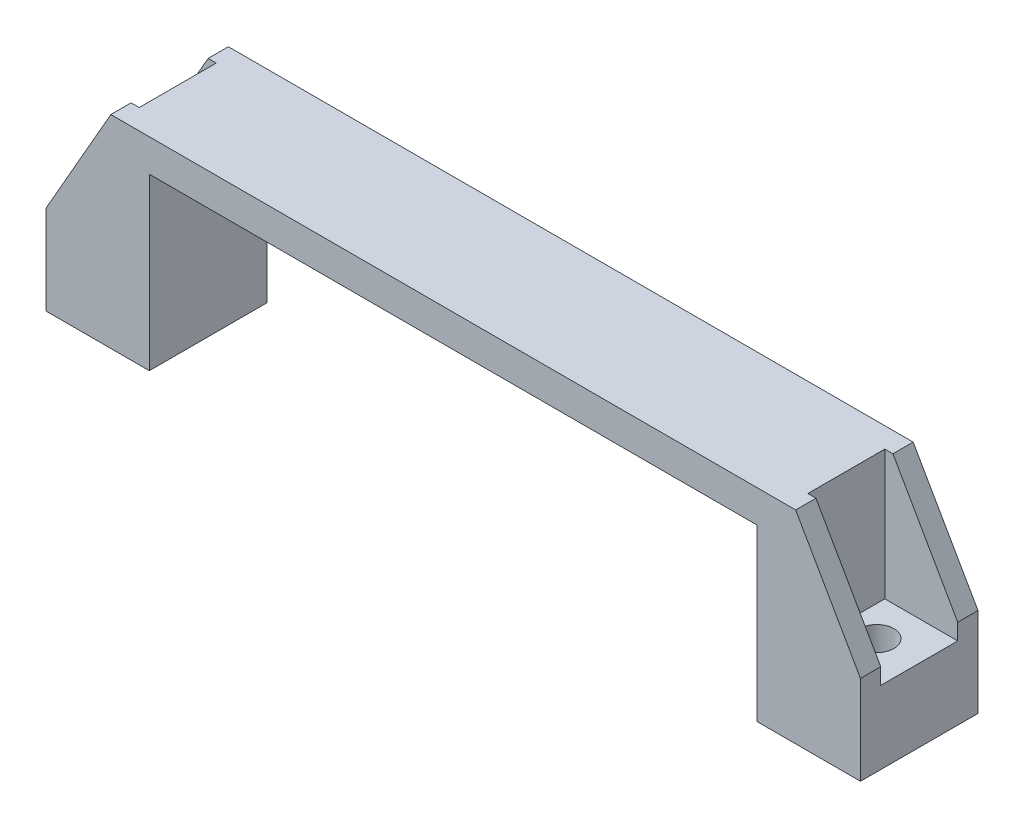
ISO-10303-21;
HEADER;
FILE_DESCRIPTION(('STEP AP214'),'2;1');
FILE_NAME('part.step','',(''),(''),'','','');
FILE_SCHEMA(('AUTOMOTIVE_DESIGN { 1 0 10303 214 1 1 1 1 }'));
ENDSEC;
DATA;
#1=APPLICATION_CONTEXT('core data for automotive mechanical design processes');
#2=APPLICATION_PROTOCOL_DEFINITION('international standard','automotive_design',2000,#1);
#3=PRODUCT_CONTEXT('',#1,'mechanical');
#4=PRODUCT('Part','Part','',(#3));
#5=PRODUCT_RELATED_PRODUCT_CATEGORY('part','',(#4));
#6=PRODUCT_DEFINITION_FORMATION('','',#4);
#7=PRODUCT_DEFINITION_CONTEXT('part definition',#1,'design');
#8=PRODUCT_DEFINITION('design','',#6,#7);
#9=PRODUCT_DEFINITION_SHAPE('','',#8);
#10=(LENGTH_UNIT() NAMED_UNIT(*) SI_UNIT(.MILLI.,.METRE.));
#11=(NAMED_UNIT(*) PLANE_ANGLE_UNIT() SI_UNIT($,.RADIAN.));
#12=(NAMED_UNIT(*) SI_UNIT($,.STERADIAN.) SOLID_ANGLE_UNIT());
#13=UNCERTAINTY_MEASURE_WITH_UNIT(LENGTH_MEASURE(1.E-05),#10,'distance_accuracy_value','');
#14=(GEOMETRIC_REPRESENTATION_CONTEXT(3) GLOBAL_UNCERTAINTY_ASSIGNED_CONTEXT((#13)) GLOBAL_UNIT_ASSIGNED_CONTEXT((#10,
#11,#12)) REPRESENTATION_CONTEXT('',''));
#15=CARTESIAN_POINT('',(0.,0.,0.));
#16=DIRECTION('',(0.,0.,1.));
#17=DIRECTION('',(1.,0.,0.));
#18=AXIS2_PLACEMENT_3D('',#15,#16,#17);
#19=CARTESIAN_POINT('',(100.5,-3.,-14.5));
#20=DIRECTION('',(-0.868243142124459,-0.496138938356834,0.));
#21=DIRECTION('',(0.496138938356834,-0.868243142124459,0.));
#22=AXIS2_PLACEMENT_3D('',#19,#20,#21);
#23=PLANE('',#22);
#24=DIRECTION('',(0.,0.,1.));
#25=VECTOR('',#24,1.);
#26=CARTESIAN_POINT('',(84.5,25.,-14.5));
#27=LINE('',#26,#25);
#28=CARTESIAN_POINT('',(84.5,25.,-14.5));
#29=VERTEX_POINT('',#28);
#30=CARTESIAN_POINT('',(84.5,25.,-9.50000000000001));
#31=VERTEX_POINT('',#30);
#32=EDGE_CURVE('E257',#29,#31,#27,.T.);
#33=ORIENTED_EDGE('',*,*,#32,.T.);
#34=DIRECTION('',(0.496138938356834,-0.868243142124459,0.));
#35=VECTOR('',#34,1.);
#36=CARTESIAN_POINT('',(100.5,-3.,-9.50000000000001));
#37=LINE('',#36,#35);
#38=CARTESIAN_POINT('',(100.5,-3.,-9.50000000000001));
#39=VERTEX_POINT('',#38);
#40=EDGE_CURVE('E11',#31,#39,#37,.T.);
#41=ORIENTED_EDGE('',*,*,#40,.T.);
#42=DIRECTION('',(0.,0.,1.));
#43=VECTOR('',#42,1.);
#44=CARTESIAN_POINT('',(100.5,-3.,-14.5));
#45=LINE('',#44,#43);
#46=CARTESIAN_POINT('',(100.5,-3.,-14.5));
#47=VERTEX_POINT('',#46);
#48=EDGE_CURVE('E252',#47,#39,#45,.T.);
#49=ORIENTED_EDGE('',*,*,#48,.F.);
#50=DIRECTION('',(0.496138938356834,-0.868243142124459,0.));
#51=VECTOR('',#50,1.);
#52=CARTESIAN_POINT('',(100.5,-3.,-14.5));
#53=LINE('',#52,#51);
#54=EDGE_CURVE('E246',#29,#47,#53,.T.);
#55=ORIENTED_EDGE('',*,*,#54,.F.);
#56=EDGE_LOOP('',(#33,#41,#49,#55));
#57=FACE_BOUND('',#56,.T.);
#58=ADVANCED_FACE('F33',(#57),#23,.F.);
#59=CARTESIAN_POINT('',(90.,25.,0.));
#60=DIRECTION('',(0.,-1.,0.));
#61=DIRECTION('',(0.,0.,-1.));
#62=AXIS2_PLACEMENT_3D('',#59,#60,#61);
#63=CYLINDRICAL_SURFACE('',#62,4.25000000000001);
#64=CARTESIAN_POINT('',(90.,-25.,0.));
#65=DIRECTION('',(0.,-1.,0.));
#66=DIRECTION('',(0.,0.,-1.));
#67=AXIS2_PLACEMENT_3D('',#64,#65,#66);
#68=CIRCLE('',#67,4.25000000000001);
#69=CARTESIAN_POINT('',(90.,-25.,-4.25000000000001));
#70=VERTEX_POINT('',#69);
#71=EDGE_CURVE('E239',#70,#70,#68,.T.);
#72=ORIENTED_EDGE('',*,*,#71,.T.);
#73=EDGE_LOOP('',(#72));
#74=FACE_BOUND('',#73,.T.);
#75=CARTESIAN_POINT('',(90.,-7.,0.));
#76=DIRECTION('',(0.,1.,0.));
#77=DIRECTION('',(0.,0.,1.));
#78=AXIS2_PLACEMENT_3D('',#75,#76,#77);
#79=CIRCLE('',#78,4.25000000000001);
#80=CARTESIAN_POINT('',(90.,-7.,4.25000000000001));
#81=VERTEX_POINT('',#80);
#82=EDGE_CURVE('E205',#81,#81,#79,.F.);
#83=ORIENTED_EDGE('',*,*,#82,.F.);
#84=EDGE_LOOP('',(#83));
#85=FACE_BOUND('',#84,.T.);
#86=ADVANCED_FACE('F415',(#74,#85),#63,.F.);
#87=CARTESIAN_POINT('',(-100.5,-3.,-14.5));
#88=DIRECTION('',(0.868243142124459,-0.496138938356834,0.));
#89=DIRECTION('',(0.496138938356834,0.868243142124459,0.));
#90=AXIS2_PLACEMENT_3D('',#87,#88,#89);
#91=PLANE('',#90);
#92=DIRECTION('',(0.,0.,1.));
#93=VECTOR('',#92,1.);
#94=CARTESIAN_POINT('',(-100.5,-3.,-14.5));
#95=LINE('',#94,#93);
#96=CARTESIAN_POINT('',(-100.5,-3.,-14.5));
#97=VERTEX_POINT('',#96);
#98=CARTESIAN_POINT('',(-100.5,-3.,-9.5));
#99=VERTEX_POINT('',#98);
#100=EDGE_CURVE('E266',#97,#99,#95,.T.);
#101=ORIENTED_EDGE('',*,*,#100,.T.);
#102=DIRECTION('',(0.496138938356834,0.868243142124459,0.));
#103=VECTOR('',#102,1.);
#104=CARTESIAN_POINT('',(-100.5,-3.,-9.5));
#105=LINE('',#104,#103);
#106=CARTESIAN_POINT('',(-84.5,25.,-9.5));
#107=VERTEX_POINT('',#106);
#108=EDGE_CURVE('E332',#99,#107,#105,.T.);
#109=ORIENTED_EDGE('',*,*,#108,.T.);
#110=DIRECTION('',(0.,0.,1.));
#111=VECTOR('',#110,1.);
#112=CARTESIAN_POINT('',(-84.5,25.,-14.5));
#113=LINE('',#112,#111);
#114=CARTESIAN_POINT('',(-84.5,25.,-14.5));
#115=VERTEX_POINT('',#114);
#116=EDGE_CURVE('E271',#115,#107,#113,.T.);
#117=ORIENTED_EDGE('',*,*,#116,.F.);
#118=DIRECTION('',(0.496138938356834,0.868243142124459,0.));
#119=VECTOR('',#118,1.);
#120=CARTESIAN_POINT('',(-100.5,-3.,-14.5));
#121=LINE('',#120,#119);
#122=EDGE_CURVE('E260',#97,#115,#121,.T.);
#123=ORIENTED_EDGE('',*,*,#122,.F.);
#124=EDGE_LOOP('',(#101,#109,#117,#123));
#125=FACE_BOUND('',#124,.T.);
#126=ADVANCED_FACE('F391',(#125),#91,.F.);
#127=CARTESIAN_POINT('',(-90.,25.,0.));
#128=DIRECTION('',(0.,-1.,0.));
#129=DIRECTION('',(0.,0.,-1.));
#130=AXIS2_PLACEMENT_3D('',#127,#128,#129);
#131=CYLINDRICAL_SURFACE('',#130,4.25000000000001);
#132=CARTESIAN_POINT('',(-90.,-25.,0.));
#133=DIRECTION('',(0.,-1.,0.));
#134=DIRECTION('',(0.,0.,-1.));
#135=AXIS2_PLACEMENT_3D('',#132,#133,#134);
#136=CIRCLE('',#135,4.25000000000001);
#137=CARTESIAN_POINT('',(-90.,-25.,-4.25000000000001));
#138=VERTEX_POINT('',#137);
#139=EDGE_CURVE('E242',#138,#138,#136,.T.);
#140=ORIENTED_EDGE('',*,*,#139,.T.);
#141=EDGE_LOOP('',(#140));
#142=FACE_BOUND('',#141,.T.);
#143=CARTESIAN_POINT('',(-90.,-7.,0.));
#144=DIRECTION('',(0.,1.,0.));
#145=DIRECTION('',(0.,0.,1.));
#146=AXIS2_PLACEMENT_3D('',#143,#144,#145);
#147=CIRCLE('',#146,4.25000000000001);
#148=CARTESIAN_POINT('',(-90.,-7.,4.25000000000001));
#149=VERTEX_POINT('',#148);
#150=EDGE_CURVE('E232',#149,#149,#147,.F.);
#151=ORIENTED_EDGE('',*,*,#150,.F.);
#152=EDGE_LOOP('',(#151));
#153=FACE_BOUND('',#152,.T.);
#154=ADVANCED_FACE('F433',(#142,#153),#131,.F.);
#155=CARTESIAN_POINT('',(-100.5,-25.,14.5));
#156=DIRECTION('',(0.,1.,0.));
#157=DIRECTION('',(0.,0.,1.));
#158=AXIS2_PLACEMENT_3D('',#155,#156,#157);
#159=PLANE('',#158);
#160=ORIENTED_EDGE('',*,*,#139,.F.);
#161=EDGE_LOOP('',(#160));
#162=FACE_BOUND('',#161,.T.);
#163=DIRECTION('',(1.,0.,0.));
#164=VECTOR('',#163,1.);
#165=CARTESIAN_POINT('',(-100.5,-25.,-14.5));
#166=LINE('',#165,#164);
#167=CARTESIAN_POINT('',(-100.5,-25.,-14.5));
#168=VERTEX_POINT('',#167);
#169=CARTESIAN_POINT('',(-75.,-25.,-14.5));
#170=VERTEX_POINT('',#169);
#171=EDGE_CURVE('E316',#168,#170,#166,.T.);
#172=ORIENTED_EDGE('',*,*,#171,.T.);
#173=DIRECTION('',(0.,0.,1.));
#174=VECTOR('',#173,1.);
#175=CARTESIAN_POINT('',(-75.,-25.,-14.5));
#176=LINE('',#175,#174);
#177=CARTESIAN_POINT('',(-75.,-25.,14.5));
#178=VERTEX_POINT('',#177);
#179=EDGE_CURVE('E284',#170,#178,#176,.T.);
#180=ORIENTED_EDGE('',*,*,#179,.T.);
#181=DIRECTION('',(1.,0.,0.));
#182=VECTOR('',#181,1.);
#183=CARTESIAN_POINT('',(-100.5,-25.,14.5));
#184=LINE('',#183,#182);
#185=CARTESIAN_POINT('',(-100.5,-25.,14.5));
#186=VERTEX_POINT('',#185);
#187=EDGE_CURVE('E304',#186,#178,#184,.T.);
#188=ORIENTED_EDGE('',*,*,#187,.F.);
#189=DIRECTION('',(0.,0.,-1.));
#190=VECTOR('',#189,1.);
#191=CARTESIAN_POINT('',(-100.5,-25.,14.5));
#192=LINE('',#191,#190);
#193=EDGE_CURVE('E325',#186,#168,#192,.T.);
#194=ORIENTED_EDGE('',*,*,#193,.T.);
#195=EDGE_LOOP('',(#172,#180,#188,#194));
#196=FACE_BOUND('',#195,.T.);
#197=ADVANCED_FACE('F359',(#162,#196),#159,.F.);
#198=CARTESIAN_POINT('',(-100.5,25.,14.5));
#199=DIRECTION('',(1.,0.,0.));
#200=DIRECTION('',(0.,1.,0.));
#201=AXIS2_PLACEMENT_3D('',#198,#199,#200);
#202=PLANE('',#201);
#203=DIRECTION('',(0.,0.,1.));
#204=VECTOR('',#203,1.);
#205=CARTESIAN_POINT('',(-100.5,-7.,-9.5));
#206=LINE('',#205,#204);
#207=CARTESIAN_POINT('',(-100.5,-7.,-9.5));
#208=VERTEX_POINT('',#207);
#209=CARTESIAN_POINT('',(-100.5,-7.,9.5));
#210=VERTEX_POINT('',#209);
#211=EDGE_CURVE('E210',#208,#210,#206,.T.);
#212=ORIENTED_EDGE('',*,*,#211,.F.);
#213=DIRECTION('',(0.,1.,0.));
#214=VECTOR('',#213,1.);
#215=CARTESIAN_POINT('',(-100.5,-7.,-9.5));
#216=LINE('',#215,#214);
#217=EDGE_CURVE('E229',#208,#99,#216,.T.);
#218=ORIENTED_EDGE('',*,*,#217,.T.);
#219=ORIENTED_EDGE('',*,*,#100,.F.);
#220=DIRECTION('',(0.,-1.,0.));
#221=VECTOR('',#220,1.);
#222=CARTESIAN_POINT('',(-100.5,25.,-14.5));
#223=LINE('',#222,#221);
#224=EDGE_CURVE('E293',#97,#168,#223,.T.);
#225=ORIENTED_EDGE('',*,*,#224,.T.);
#226=ORIENTED_EDGE('',*,*,#193,.F.);
#227=DIRECTION('',(0.,-1.,0.));
#228=VECTOR('',#227,1.);
#229=CARTESIAN_POINT('',(-100.5,25.,14.5));
#230=LINE('',#229,#228);
#231=CARTESIAN_POINT('',(-100.5,-3.,14.5));
#232=VERTEX_POINT('',#231);
#233=EDGE_CURVE('E300',#232,#186,#230,.T.);
#234=ORIENTED_EDGE('',*,*,#233,.F.);
#235=CARTESIAN_POINT('',(-100.5,-3.,9.49999999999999));
#236=VERTEX_POINT('',#235);
#237=EDGE_CURVE('E270',#236,#232,#95,.T.);
#238=ORIENTED_EDGE('',*,*,#237,.F.);
#239=DIRECTION('',(0.,1.,0.));
#240=VECTOR('',#239,1.);
#241=CARTESIAN_POINT('',(-100.5,-7.,9.5));
#242=LINE('',#241,#240);
#243=EDGE_CURVE('E56',#210,#236,#242,.T.);
#244=ORIENTED_EDGE('',*,*,#243,.F.);
#245=EDGE_LOOP('',(#212,#218,#219,#225,#226,#234,#238,#244));
#246=FACE_BOUND('',#245,.T.);
#247=ADVANCED_FACE('F35',(#246),#202,.F.);
#248=ORIENTED_EDGE('',*,*,#71,.F.);
#249=EDGE_LOOP('',(#248));
#250=FACE_BOUND('',#249,.T.);
#251=CARTESIAN_POINT('',(75.,-25.,14.5));
#252=VERTEX_POINT('',#251);
#253=CARTESIAN_POINT('',(100.5,-25.,14.5));
#254=VERTEX_POINT('',#253);
#255=EDGE_CURVE('E302',#252,#254,#184,.T.);
#256=ORIENTED_EDGE('',*,*,#255,.F.);
#257=DIRECTION('',(0.,0.,1.));
#258=VECTOR('',#257,1.);
#259=CARTESIAN_POINT('',(75.,-25.,-14.5));
#260=LINE('',#259,#258);
#261=CARTESIAN_POINT('',(75.,-25.,-14.5));
#262=VERTEX_POINT('',#261);
#263=EDGE_CURVE('E296',#262,#252,#260,.T.);
#264=ORIENTED_EDGE('',*,*,#263,.F.);
#265=CARTESIAN_POINT('',(100.5,-25.,-14.5));
#266=VERTEX_POINT('',#265);
#267=EDGE_CURVE('E315',#262,#266,#166,.T.);
#268=ORIENTED_EDGE('',*,*,#267,.T.);
#269=DIRECTION('',(0.,0.,-1.));
#270=VECTOR('',#269,1.);
#271=CARTESIAN_POINT('',(100.5,-25.,14.5));
#272=LINE('',#271,#270);
#273=EDGE_CURVE('E313',#254,#266,#272,.T.);
#274=ORIENTED_EDGE('',*,*,#273,.F.);
#275=EDGE_LOOP('',(#256,#264,#268,#274));
#276=FACE_BOUND('',#275,.T.);
#277=ADVANCED_FACE('F380',(#250,#276),#159,.F.);
#278=CARTESIAN_POINT('',(100.5,25.,14.5));
#279=DIRECTION('',(-1.,0.,0.));
#280=DIRECTION('',(0.,-1.,0.));
#281=AXIS2_PLACEMENT_3D('',#278,#279,#280);
#282=PLANE('',#281);
#283=ORIENTED_EDGE('',*,*,#48,.T.);
#284=DIRECTION('',(0.,1.,0.));
#285=VECTOR('',#284,1.);
#286=CARTESIAN_POINT('',(100.5,-7.,-9.50000000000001));
#287=LINE('',#286,#285);
#288=CARTESIAN_POINT('',(100.5,-7.,-9.50000000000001));
#289=VERTEX_POINT('',#288);
#290=EDGE_CURVE('E203',#289,#39,#287,.T.);
#291=ORIENTED_EDGE('',*,*,#290,.F.);
#292=DIRECTION('',(0.,0.,-1.));
#293=VECTOR('',#292,1.);
#294=CARTESIAN_POINT('',(100.5,-7.,-9.50000000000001));
#295=LINE('',#294,#293);
#296=CARTESIAN_POINT('',(100.5,-7.,9.49999999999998));
#297=VERTEX_POINT('',#296);
#298=EDGE_CURVE('E181',#297,#289,#295,.T.);
#299=ORIENTED_EDGE('',*,*,#298,.F.);
#300=DIRECTION('',(0.,1.,0.));
#301=VECTOR('',#300,1.);
#302=CARTESIAN_POINT('',(100.5,-7.,9.49999999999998));
#303=LINE('',#302,#301);
#304=CARTESIAN_POINT('',(100.5,-3.,9.49999999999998));
#305=VERTEX_POINT('',#304);
#306=EDGE_CURVE('E206',#297,#305,#303,.T.);
#307=ORIENTED_EDGE('',*,*,#306,.T.);
#308=CARTESIAN_POINT('',(100.5,-3.,14.5));
#309=VERTEX_POINT('',#308);
#310=EDGE_CURVE('E256',#305,#309,#45,.T.);
#311=ORIENTED_EDGE('',*,*,#310,.T.);
#312=DIRECTION('',(0.,1.,0.));
#313=VECTOR('',#312,1.);
#314=CARTESIAN_POINT('',(100.5,25.,14.5));
#315=LINE('',#314,#313);
#316=EDGE_CURVE('E307',#254,#309,#315,.T.);
#317=ORIENTED_EDGE('',*,*,#316,.F.);
#318=ORIENTED_EDGE('',*,*,#273,.T.);
#319=DIRECTION('',(0.,1.,0.));
#320=VECTOR('',#319,1.);
#321=CARTESIAN_POINT('',(100.5,25.,-14.5));
#322=LINE('',#321,#320);
#323=EDGE_CURVE('E319',#266,#47,#322,.T.);
#324=ORIENTED_EDGE('',*,*,#323,.T.);
#325=EDGE_LOOP('',(#283,#291,#299,#307,#311,#317,#318,#324));
#326=FACE_BOUND('',#325,.T.);
#327=ADVANCED_FACE('F384',(#326),#282,.F.);
#328=CARTESIAN_POINT('',(-100.5,25.,14.5));
#329=DIRECTION('',(0.,-1.,0.));
#330=DIRECTION('',(1.,0.,0.));
#331=AXIS2_PLACEMENT_3D('',#328,#329,#330);
#332=PLANE('',#331);
#333=DIRECTION('',(0.,0.,1.));
#334=VECTOR('',#333,1.);
#335=CARTESIAN_POINT('',(82.5,25.,-9.50000000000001));
#336=LINE('',#335,#334);
#337=CARTESIAN_POINT('',(82.5,25.,-9.50000000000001));
#338=VERTEX_POINT('',#337);
#339=CARTESIAN_POINT('',(82.5,25.,9.49999999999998));
#340=VERTEX_POINT('',#339);
#341=EDGE_CURVE('E196',#338,#340,#336,.T.);
#342=ORIENTED_EDGE('',*,*,#341,.F.);
#343=DIRECTION('',(-1.,0.,0.));
#344=VECTOR('',#343,1.);
#345=CARTESIAN_POINT('',(100.5,25.,-9.50000000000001));
#346=LINE('',#345,#344);
#347=EDGE_CURVE('E176',#31,#338,#346,.T.);
#348=ORIENTED_EDGE('',*,*,#347,.F.);
#349=ORIENTED_EDGE('',*,*,#32,.F.);
#350=DIRECTION('',(-1.,0.,0.));
#351=VECTOR('',#350,1.);
#352=CARTESIAN_POINT('',(-100.5,25.,-14.5));
#353=LINE('',#352,#351);
#354=EDGE_CURVE('E303',#29,#115,#353,.T.);
#355=ORIENTED_EDGE('',*,*,#354,.T.);
#356=ORIENTED_EDGE('',*,*,#116,.T.);
#357=DIRECTION('',(-1.,0.,0.));
#358=VECTOR('',#357,1.);
#359=CARTESIAN_POINT('',(-100.5,25.,-9.5));
#360=LINE('',#359,#358);
#361=CARTESIAN_POINT('',(-82.5,25.,-9.5));
#362=VERTEX_POINT('',#361);
#363=EDGE_CURVE('E214',#362,#107,#360,.T.);
#364=ORIENTED_EDGE('',*,*,#363,.F.);
#365=DIRECTION('',(0.,0.,-1.));
#366=VECTOR('',#365,1.);
#367=CARTESIAN_POINT('',(-82.5,25.,-9.5));
#368=LINE('',#367,#366);
#369=CARTESIAN_POINT('',(-82.5,25.,9.5));
#370=VERTEX_POINT('',#369);
#371=EDGE_CURVE('E225',#370,#362,#368,.T.);
#372=ORIENTED_EDGE('',*,*,#371,.F.);
#373=DIRECTION('',(1.,0.,0.));
#374=VECTOR('',#373,1.);
#375=CARTESIAN_POINT('',(-100.5,25.,9.5));
#376=LINE('',#375,#374);
#377=CARTESIAN_POINT('',(-84.5,25.,9.5));
#378=VERTEX_POINT('',#377);
#379=EDGE_CURVE('E223',#378,#370,#376,.T.);
#380=ORIENTED_EDGE('',*,*,#379,.F.);
#381=CARTESIAN_POINT('',(-84.5,25.,14.5));
#382=VERTEX_POINT('',#381);
#383=EDGE_CURVE('E263',#378,#382,#113,.T.);
#384=ORIENTED_EDGE('',*,*,#383,.T.);
#385=DIRECTION('',(-1.,0.,0.));
#386=VECTOR('',#385,1.);
#387=CARTESIAN_POINT('',(-100.5,25.,14.5));
#388=LINE('',#387,#386);
#389=CARTESIAN_POINT('',(84.5,25.,14.5));
#390=VERTEX_POINT('',#389);
#391=EDGE_CURVE('E310',#390,#382,#388,.T.);
#392=ORIENTED_EDGE('',*,*,#391,.F.);
#393=CARTESIAN_POINT('',(84.5,25.,9.49999999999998));
#394=VERTEX_POINT('',#393);
#395=EDGE_CURVE('E249',#394,#390,#27,.T.);
#396=ORIENTED_EDGE('',*,*,#395,.F.);
#397=DIRECTION('',(1.,0.,0.));
#398=VECTOR('',#397,1.);
#399=CARTESIAN_POINT('',(100.5,25.,9.49999999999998));
#400=LINE('',#399,#398);
#401=EDGE_CURVE('E48',#340,#394,#400,.T.);
#402=ORIENTED_EDGE('',*,*,#401,.F.);
#403=EDGE_LOOP('',(#342,#348,#349,#355,#356,#364,#372,#380,#384,#392,#396,#402));
#404=FACE_BOUND('',#403,.T.);
#405=ADVANCED_FACE('F343',(#404),#332,.F.);
#406=CARTESIAN_POINT('',(0.,0.,14.5));
#407=DIRECTION('',(0.,0.,1.));
#408=DIRECTION('',(1.,0.,0.));
#409=AXIS2_PLACEMENT_3D('',#406,#407,#408);
#410=PLANE('',#409);
#411=DIRECTION('',(0.496138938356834,-0.868243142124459,0.));
#412=VECTOR('',#411,1.);
#413=CARTESIAN_POINT('',(100.5,-3.,14.5));
#414=LINE('',#413,#412);
#415=EDGE_CURVE('E245',#390,#309,#414,.T.);
#416=ORIENTED_EDGE('',*,*,#415,.F.);
#417=ORIENTED_EDGE('',*,*,#391,.T.);
#418=DIRECTION('',(0.496138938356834,0.868243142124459,0.));
#419=VECTOR('',#418,1.);
#420=CARTESIAN_POINT('',(-100.5,-3.,14.5));
#421=LINE('',#420,#419);
#422=EDGE_CURVE('E255',#232,#382,#421,.T.);
#423=ORIENTED_EDGE('',*,*,#422,.F.);
#424=ORIENTED_EDGE('',*,*,#233,.T.);
#425=ORIENTED_EDGE('',*,*,#187,.T.);
#426=DIRECTION('',(0.,-1.,0.));
#427=VECTOR('',#426,1.);
#428=CARTESIAN_POINT('',(-75.,17.,14.5));
#429=LINE('',#428,#427);
#430=CARTESIAN_POINT('',(-75.,17.,14.5));
#431=VERTEX_POINT('',#430);
#432=EDGE_CURVE('E269',#431,#178,#429,.T.);
#433=ORIENTED_EDGE('',*,*,#432,.F.);
#434=DIRECTION('',(-1.,0.,0.));
#435=VECTOR('',#434,1.);
#436=CARTESIAN_POINT('',(-75.,17.,14.5));
#437=LINE('',#436,#435);
#438=CARTESIAN_POINT('',(75.,17.,14.5));
#439=VERTEX_POINT('',#438);
#440=EDGE_CURVE('E278',#439,#431,#437,.T.);
#441=ORIENTED_EDGE('',*,*,#440,.F.);
#442=DIRECTION('',(0.,1.,0.));
#443=VECTOR('',#442,1.);
#444=CARTESIAN_POINT('',(75.,17.,14.5));
#445=LINE('',#444,#443);
#446=EDGE_CURVE('E286',#252,#439,#445,.T.);
#447=ORIENTED_EDGE('',*,*,#446,.F.);
#448=ORIENTED_EDGE('',*,*,#255,.T.);
#449=ORIENTED_EDGE('',*,*,#316,.T.);
#450=EDGE_LOOP('',(#416,#417,#423,#424,#425,#433,#441,#447,#448,#449));
#451=FACE_BOUND('',#450,.T.);
#452=ADVANCED_FACE('F348',(#451),#410,.T.);
#453=CARTESIAN_POINT('',(0.,0.,-14.5));
#454=DIRECTION('',(0.,0.,1.));
#455=DIRECTION('',(1.,0.,0.));
#456=AXIS2_PLACEMENT_3D('',#453,#454,#455);
#457=PLANE('',#456);
#458=ORIENTED_EDGE('',*,*,#354,.F.);
#459=ORIENTED_EDGE('',*,*,#54,.T.);
#460=ORIENTED_EDGE('',*,*,#323,.F.);
#461=ORIENTED_EDGE('',*,*,#267,.F.);
#462=DIRECTION('',(0.,1.,0.));
#463=VECTOR('',#462,1.);
#464=CARTESIAN_POINT('',(75.,17.,-14.5));
#465=LINE('',#464,#463);
#466=CARTESIAN_POINT('',(75.,17.,-14.5));
#467=VERTEX_POINT('',#466);
#468=EDGE_CURVE('E277',#262,#467,#465,.T.);
#469=ORIENTED_EDGE('',*,*,#468,.T.);
#470=DIRECTION('',(-1.,0.,0.));
#471=VECTOR('',#470,1.);
#472=CARTESIAN_POINT('',(-75.,17.,-14.5));
#473=LINE('',#472,#471);
#474=CARTESIAN_POINT('',(-75.,17.,-14.5));
#475=VERTEX_POINT('',#474);
#476=EDGE_CURVE('E281',#467,#475,#473,.T.);
#477=ORIENTED_EDGE('',*,*,#476,.T.);
#478=DIRECTION('',(0.,-1.,0.));
#479=VECTOR('',#478,1.);
#480=CARTESIAN_POINT('',(-75.,17.,-14.5));
#481=LINE('',#480,#479);
#482=EDGE_CURVE('E274',#475,#170,#481,.T.);
#483=ORIENTED_EDGE('',*,*,#482,.T.);
#484=ORIENTED_EDGE('',*,*,#171,.F.);
#485=ORIENTED_EDGE('',*,*,#224,.F.);
#486=ORIENTED_EDGE('',*,*,#122,.T.);
#487=EDGE_LOOP('',(#458,#459,#460,#461,#469,#477,#483,#484,#485,#486));
#488=FACE_BOUND('',#487,.T.);
#489=ADVANCED_FACE('F366',(#488),#457,.F.);
#490=CARTESIAN_POINT('',(-75.,17.,-14.5));
#491=DIRECTION('',(-1.,0.,0.));
#492=DIRECTION('',(0.,0.,1.));
#493=AXIS2_PLACEMENT_3D('',#490,#491,#492);
#494=PLANE('',#493);
#495=ORIENTED_EDGE('',*,*,#432,.T.);
#496=ORIENTED_EDGE('',*,*,#179,.F.);
#497=ORIENTED_EDGE('',*,*,#482,.F.);
#498=DIRECTION('',(0.,0.,1.));
#499=VECTOR('',#498,1.);
#500=CARTESIAN_POINT('',(-75.,17.,-14.5));
#501=LINE('',#500,#499);
#502=EDGE_CURVE('E291',#475,#431,#501,.T.);
#503=ORIENTED_EDGE('',*,*,#502,.T.);
#504=EDGE_LOOP('',(#495,#496,#497,#503));
#505=FACE_BOUND('',#504,.T.);
#506=ADVANCED_FACE('F363',(#505),#494,.F.);
#507=CARTESIAN_POINT('',(-75.,17.,-14.5));
#508=DIRECTION('',(0.,1.,0.));
#509=DIRECTION('',(-1.,0.,0.));
#510=AXIS2_PLACEMENT_3D('',#507,#508,#509);
#511=PLANE('',#510);
#512=ORIENTED_EDGE('',*,*,#440,.T.);
#513=ORIENTED_EDGE('',*,*,#502,.F.);
#514=ORIENTED_EDGE('',*,*,#476,.F.);
#515=DIRECTION('',(0.,0.,1.));
#516=VECTOR('',#515,1.);
#517=CARTESIAN_POINT('',(75.,17.,-14.5));
#518=LINE('',#517,#516);
#519=EDGE_CURVE('E294',#467,#439,#518,.T.);
#520=ORIENTED_EDGE('',*,*,#519,.T.);
#521=EDGE_LOOP('',(#512,#513,#514,#520));
#522=FACE_BOUND('',#521,.T.);
#523=ADVANCED_FACE('F371',(#522),#511,.F.);
#524=CARTESIAN_POINT('',(75.,17.,-14.5));
#525=DIRECTION('',(1.,0.,0.));
#526=DIRECTION('',(0.,1.,0.));
#527=AXIS2_PLACEMENT_3D('',#524,#525,#526);
#528=PLANE('',#527);
#529=ORIENTED_EDGE('',*,*,#446,.T.);
#530=ORIENTED_EDGE('',*,*,#519,.F.);
#531=ORIENTED_EDGE('',*,*,#468,.F.);
#532=ORIENTED_EDGE('',*,*,#263,.T.);
#533=EDGE_LOOP('',(#529,#530,#531,#532));
#534=FACE_BOUND('',#533,.T.);
#535=ADVANCED_FACE('F373',(#534),#528,.F.);
#536=ORIENTED_EDGE('',*,*,#383,.F.);
#537=DIRECTION('',(-0.496138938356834,-0.868243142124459,0.));
#538=VECTOR('',#537,1.);
#539=CARTESIAN_POINT('',(-100.5,-3.,9.5));
#540=LINE('',#539,#538);
#541=EDGE_CURVE('E328',#378,#236,#540,.T.);
#542=ORIENTED_EDGE('',*,*,#541,.T.);
#543=ORIENTED_EDGE('',*,*,#237,.T.);
#544=ORIENTED_EDGE('',*,*,#422,.T.);
#545=EDGE_LOOP('',(#536,#542,#543,#544));
#546=FACE_BOUND('',#545,.T.);
#547=ADVANCED_FACE('F351',(#546),#91,.F.);
#548=ORIENTED_EDGE('',*,*,#310,.F.);
#549=DIRECTION('',(-0.496138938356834,0.868243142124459,0.));
#550=VECTOR('',#549,1.);
#551=CARTESIAN_POINT('',(100.5,-3.,9.49999999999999));
#552=LINE('',#551,#550);
#553=EDGE_CURVE('E41',#305,#394,#552,.T.);
#554=ORIENTED_EDGE('',*,*,#553,.T.);
#555=ORIENTED_EDGE('',*,*,#395,.T.);
#556=ORIENTED_EDGE('',*,*,#415,.T.);
#557=EDGE_LOOP('',(#548,#554,#555,#556));
#558=FACE_BOUND('',#557,.T.);
#559=ADVANCED_FACE('F339',(#558),#23,.F.);
#560=CARTESIAN_POINT('',(-100.5,-7.,-9.5));
#561=DIRECTION('',(0.,0.,-1.));
#562=DIRECTION('',(-1.,0.,0.));
#563=AXIS2_PLACEMENT_3D('',#560,#561,#562);
#564=PLANE('',#563);
#565=ORIENTED_EDGE('',*,*,#217,.F.);
#566=DIRECTION('',(-1.,0.,0.));
#567=VECTOR('',#566,1.);
#568=CARTESIAN_POINT('',(-100.5,-7.,-9.5));
#569=LINE('',#568,#567);
#570=CARTESIAN_POINT('',(-82.5,-7.,-9.5));
#571=VERTEX_POINT('',#570);
#572=EDGE_CURVE('E220',#571,#208,#569,.T.);
#573=ORIENTED_EDGE('',*,*,#572,.F.);
#574=DIRECTION('',(0.,1.,0.));
#575=VECTOR('',#574,1.);
#576=CARTESIAN_POINT('',(-82.5,-7.,-9.5));
#577=LINE('',#576,#575);
#578=EDGE_CURVE('E233',#571,#362,#577,.T.);
#579=ORIENTED_EDGE('',*,*,#578,.T.);
#580=ORIENTED_EDGE('',*,*,#363,.T.);
#581=ORIENTED_EDGE('',*,*,#108,.F.);
#582=EDGE_LOOP('',(#565,#573,#579,#580,#581));
#583=FACE_BOUND('',#582,.T.);
#584=ADVANCED_FACE('F394',(#583),#564,.F.);
#585=CARTESIAN_POINT('',(-100.5,-7.,9.5));
#586=DIRECTION('',(0.,0.,1.));
#587=DIRECTION('',(1.,0.,0.));
#588=AXIS2_PLACEMENT_3D('',#585,#586,#587);
#589=PLANE('',#588);
#590=ORIENTED_EDGE('',*,*,#379,.T.);
#591=DIRECTION('',(0.,1.,0.));
#592=VECTOR('',#591,1.);
#593=CARTESIAN_POINT('',(-82.5,-7.,9.5));
#594=LINE('',#593,#592);
#595=CARTESIAN_POINT('',(-82.5,-7.,9.5));
#596=VERTEX_POINT('',#595);
#597=EDGE_CURVE('E235',#596,#370,#594,.T.);
#598=ORIENTED_EDGE('',*,*,#597,.F.);
#599=DIRECTION('',(1.,0.,0.));
#600=VECTOR('',#599,1.);
#601=CARTESIAN_POINT('',(-100.5,-7.,9.5));
#602=LINE('',#601,#600);
#603=EDGE_CURVE('E213',#210,#596,#602,.T.);
#604=ORIENTED_EDGE('',*,*,#603,.F.);
#605=ORIENTED_EDGE('',*,*,#243,.T.);
#606=ORIENTED_EDGE('',*,*,#541,.F.);
#607=EDGE_LOOP('',(#590,#598,#604,#605,#606));
#608=FACE_BOUND('',#607,.T.);
#609=ADVANCED_FACE('F403',(#608),#589,.F.);
#610=CARTESIAN_POINT('',(0.,-7.,0.));
#611=DIRECTION('',(0.,1.,0.));
#612=DIRECTION('',(0.,0.,1.));
#613=AXIS2_PLACEMENT_3D('',#610,#611,#612);
#614=PLANE('',#613);
#615=ORIENTED_EDGE('',*,*,#211,.T.);
#616=ORIENTED_EDGE('',*,*,#603,.T.);
#617=DIRECTION('',(0.,0.,-1.));
#618=VECTOR('',#617,1.);
#619=CARTESIAN_POINT('',(-82.5,-7.,-9.5));
#620=LINE('',#619,#618);
#621=EDGE_CURVE('E217',#596,#571,#620,.T.);
#622=ORIENTED_EDGE('',*,*,#621,.T.);
#623=ORIENTED_EDGE('',*,*,#572,.T.);
#624=EDGE_LOOP('',(#615,#616,#622,#623));
#625=FACE_BOUND('',#624,.T.);
#626=ORIENTED_EDGE('',*,*,#150,.T.);
#627=EDGE_LOOP('',(#626));
#628=FACE_BOUND('',#627,.T.);
#629=ADVANCED_FACE('F397',(#625,#628),#614,.T.);
#630=CARTESIAN_POINT('',(-82.5,-7.,-9.5));
#631=DIRECTION('',(1.,0.,0.));
#632=DIRECTION('',(0.,1.,0.));
#633=AXIS2_PLACEMENT_3D('',#630,#631,#632);
#634=PLANE('',#633);
#635=ORIENTED_EDGE('',*,*,#371,.T.);
#636=ORIENTED_EDGE('',*,*,#578,.F.);
#637=ORIENTED_EDGE('',*,*,#621,.F.);
#638=ORIENTED_EDGE('',*,*,#597,.T.);
#639=EDGE_LOOP('',(#635,#636,#637,#638));
#640=FACE_BOUND('',#639,.T.);
#641=ADVANCED_FACE('F402',(#640),#634,.F.);
#642=CARTESIAN_POINT('',(100.5,-7.,-9.50000000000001));
#643=DIRECTION('',(0.,0.,-1.));
#644=DIRECTION('',(-1.,0.,0.));
#645=AXIS2_PLACEMENT_3D('',#642,#643,#644);
#646=PLANE('',#645);
#647=ORIENTED_EDGE('',*,*,#347,.T.);
#648=DIRECTION('',(0.,1.,0.));
#649=VECTOR('',#648,1.);
#650=CARTESIAN_POINT('',(82.5,-7.,-9.50000000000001));
#651=LINE('',#650,#649);
#652=CARTESIAN_POINT('',(82.5,-7.,-9.50000000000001));
#653=VERTEX_POINT('',#652);
#654=EDGE_CURVE('E169',#653,#338,#651,.T.);
#655=ORIENTED_EDGE('',*,*,#654,.F.);
#656=DIRECTION('',(-1.,0.,0.));
#657=VECTOR('',#656,1.);
#658=CARTESIAN_POINT('',(100.5,-7.,-9.50000000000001));
#659=LINE('',#658,#657);
#660=EDGE_CURVE('E173',#289,#653,#659,.T.);
#661=ORIENTED_EDGE('',*,*,#660,.F.);
#662=ORIENTED_EDGE('',*,*,#290,.T.);
#663=ORIENTED_EDGE('',*,*,#40,.F.);
#664=EDGE_LOOP('',(#647,#655,#661,#662,#663));
#665=FACE_BOUND('',#664,.T.);
#666=ADVANCED_FACE('F171',(#665),#646,.F.);
#667=CARTESIAN_POINT('',(100.5,-7.,9.49999999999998));
#668=DIRECTION('',(0.,0.,1.));
#669=DIRECTION('',(1.,0.,0.));
#670=AXIS2_PLACEMENT_3D('',#667,#668,#669);
#671=PLANE('',#670);
#672=ORIENTED_EDGE('',*,*,#306,.F.);
#673=DIRECTION('',(1.,0.,0.));
#674=VECTOR('',#673,1.);
#675=CARTESIAN_POINT('',(100.5,-7.,9.49999999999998));
#676=LINE('',#675,#674);
#677=CARTESIAN_POINT('',(82.5,-7.,9.49999999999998));
#678=VERTEX_POINT('',#677);
#679=EDGE_CURVE('E189',#678,#297,#676,.T.);
#680=ORIENTED_EDGE('',*,*,#679,.F.);
#681=DIRECTION('',(0.,1.,0.));
#682=VECTOR('',#681,1.);
#683=CARTESIAN_POINT('',(82.5,-7.,9.49999999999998));
#684=LINE('',#683,#682);
#685=EDGE_CURVE('E180',#678,#340,#684,.T.);
#686=ORIENTED_EDGE('',*,*,#685,.T.);
#687=ORIENTED_EDGE('',*,*,#401,.T.);
#688=ORIENTED_EDGE('',*,*,#553,.F.);
#689=EDGE_LOOP('',(#672,#680,#686,#687,#688));
#690=FACE_BOUND('',#689,.T.);
#691=ADVANCED_FACE('F385',(#690),#671,.F.);
#692=CARTESIAN_POINT('',(0.,-7.,0.));
#693=DIRECTION('',(0.,1.,0.));
#694=DIRECTION('',(0.,0.,1.));
#695=AXIS2_PLACEMENT_3D('',#692,#693,#694);
#696=PLANE('',#695);
#697=ORIENTED_EDGE('',*,*,#660,.T.);
#698=DIRECTION('',(0.,0.,1.));
#699=VECTOR('',#698,1.);
#700=CARTESIAN_POINT('',(82.5,-7.,-9.50000000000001));
#701=LINE('',#700,#699);
#702=EDGE_CURVE('E184',#653,#678,#701,.T.);
#703=ORIENTED_EDGE('',*,*,#702,.T.);
#704=ORIENTED_EDGE('',*,*,#679,.T.);
#705=ORIENTED_EDGE('',*,*,#298,.T.);
#706=EDGE_LOOP('',(#697,#703,#704,#705));
#707=FACE_BOUND('',#706,.T.);
#708=ORIENTED_EDGE('',*,*,#82,.T.);
#709=EDGE_LOOP('',(#708));
#710=FACE_BOUND('',#709,.T.);
#711=ADVANCED_FACE('F191',(#707,#710),#696,.T.);
#712=CARTESIAN_POINT('',(82.5,-7.,-9.50000000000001));
#713=DIRECTION('',(-1.,0.,0.));
#714=DIRECTION('',(0.,-1.,0.));
#715=AXIS2_PLACEMENT_3D('',#712,#713,#714);
#716=PLANE('',#715);
#717=ORIENTED_EDGE('',*,*,#341,.T.);
#718=ORIENTED_EDGE('',*,*,#685,.F.);
#719=ORIENTED_EDGE('',*,*,#702,.F.);
#720=ORIENTED_EDGE('',*,*,#654,.T.);
#721=EDGE_LOOP('',(#717,#718,#719,#720));
#722=FACE_BOUND('',#721,.T.);
#723=ADVANCED_FACE('F185',(#722),#716,.F.);
#724=CLOSED_SHELL('',(#58,#86,#126,#154,#197,#247,#277,#327,#405,#452,#489,#506,#523,#535,#547,
#559,#584,#609,#629,#641,#666,#691,#711,#723));
#725=MANIFOLD_SOLID_BREP('B2',#724);
#726=ADVANCED_BREP_SHAPE_REPRESENTATION('',(#18,#725),#14);
#727=SHAPE_DEFINITION_REPRESENTATION(#9,#726);
ENDSEC;
END-ISO-10303-21;
